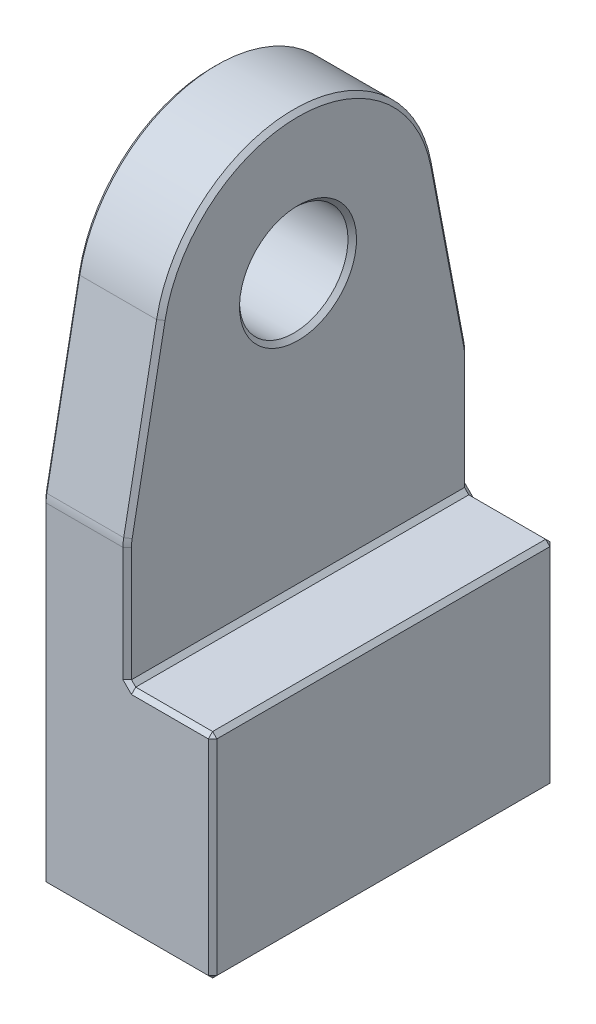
from build123d import *

# Parameters (mm, degrees)
SKETCH_1_R          = 6.35
EXTRUDE_1_DEPTH     = 20
SKETCH_2_W          = 10
SKETCH_2_H          = 48.35
CUT_EXTRUDE_1_DEPTH = 24.8
CHAMFER_1_SIZE      = 0.5


with BuildPart() as part:
    # Sketch 1 → Extrude 1 (new body)
    with BuildSketch(Plane(origin=(0, 0, 0), x_dir=(0, 0, -1), z_dir=(1, 0, 0))):
        with BuildLine():
            Line((-19.911532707, -17.135978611), (-16.060711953, 3.062030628))
            ThreePointArc((-16.060711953, 3.062030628), (0, 16.35), (16.060711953, 3.062030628))
            Line((16.060711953, 3.062030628), (19.911532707, -17.135978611))
            ThreePointArc((19.911532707, -17.135978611), (19.977834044, -17.602094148), (20, -18.072379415))
            Line((20, -18.072379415), (20, -57))
            Line((20, -57), (-20, -57))
            Line((-20, -57), (-20, -18.072379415))
            ThreePointArc((-20, -18.072379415), (-19.977834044, -17.602094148), (-19.911532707, -17.135978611))
        make_face()
        Circle(SKETCH_1_R, mode=Mode.SUBTRACT)
    extrude(amount=EXTRUDE_1_DEPTH)

    # Sketch 2 → Cut-Extrude 1 (cut, symmetric)
    with BuildSketch(Plane.XY):
        with Locations((15, -7.825)):
            Rectangle(SKETCH_2_W, SKETCH_2_H)
    extrude(amount=CUT_EXTRUDE_1_DEPTH, both=True, mode=Mode.SUBTRACT)

    # Chamfer 1
    chamfer_1_edges = [part.edges().sort_by_distance(p)[0] for p in [
        (0, -7.036973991, -17.98612233),
        (0, -17.602094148, -19.977834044),
        (10, -57, -20),
        (10, -57, 20),
        (0, 0, 6.35),
        (20, -57, 0),
        (20, -44.5, -20),
        (15, -32, -20),
        (20, -44.5, 20),
        (20, -32, 0),
        (15, -32, 20),
        (10, -32, 0),
        (10, -25.036189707, 20),
        (10, -17.602094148, 19.977834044),
        (10, -7.036973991, 17.98612233),
        (10, 16.35, 0),
        (10, -7.036973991, -17.98612233),
        (10, -17.602094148, -19.977834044),
        (10, -25.036189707, -20),
        (10, 0, 6.35),
        (0, -37.536189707, -20),
        (0, -57, 0),
        (0, -37.536189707, 20),
        (0, -17.602094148, 19.977834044),
        (0, -7.036973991, 17.98612233),
        (0, 16.35, 0),
    ]]
    chamfer(chamfer_1_edges, length=CHAMFER_1_SIZE)


solid = part.part
